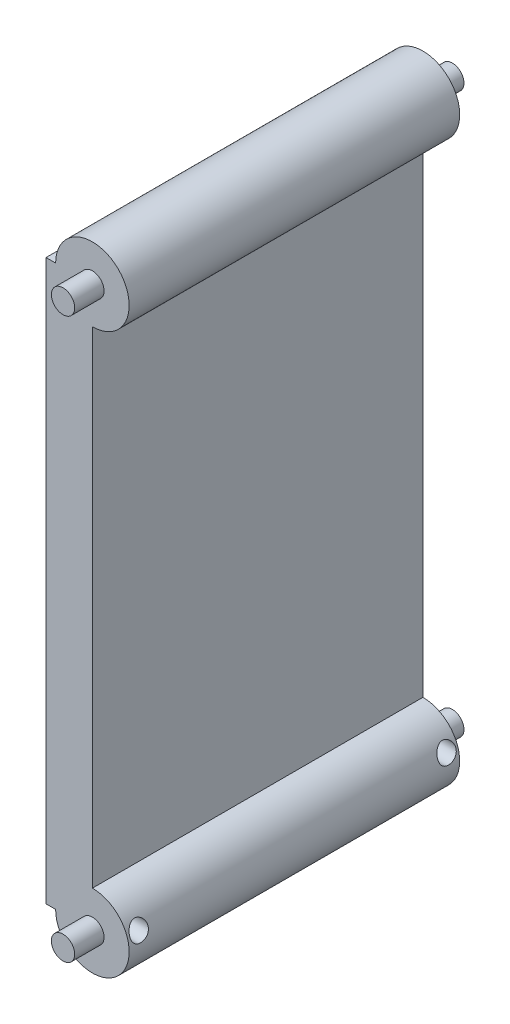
ISO-10303-21;
HEADER;
FILE_DESCRIPTION(('STEP AP214'),'2;1');
FILE_NAME('part.step','',(''),(''),'','','');
FILE_SCHEMA(('AUTOMOTIVE_DESIGN { 1 0 10303 214 1 1 1 1 }'));
ENDSEC;
DATA;
#1=APPLICATION_CONTEXT('core data for automotive mechanical design processes');
#2=APPLICATION_PROTOCOL_DEFINITION('international standard','automotive_design',2000,#1);
#3=PRODUCT_CONTEXT('',#1,'mechanical');
#4=PRODUCT('Part','Part','',(#3));
#5=PRODUCT_RELATED_PRODUCT_CATEGORY('part','',(#4));
#6=PRODUCT_DEFINITION_FORMATION('','',#4);
#7=PRODUCT_DEFINITION_CONTEXT('part definition',#1,'design');
#8=PRODUCT_DEFINITION('design','',#6,#7);
#9=PRODUCT_DEFINITION_SHAPE('','',#8);
#10=(LENGTH_UNIT() NAMED_UNIT(*) SI_UNIT(.MILLI.,.METRE.));
#11=(NAMED_UNIT(*) PLANE_ANGLE_UNIT() SI_UNIT($,.RADIAN.));
#12=(NAMED_UNIT(*) SI_UNIT($,.STERADIAN.) SOLID_ANGLE_UNIT());
#13=UNCERTAINTY_MEASURE_WITH_UNIT(LENGTH_MEASURE(1.E-05),#10,'distance_accuracy_value','');
#14=(GEOMETRIC_REPRESENTATION_CONTEXT(3) GLOBAL_UNCERTAINTY_ASSIGNED_CONTEXT((#13)) GLOBAL_UNIT_ASSIGNED_CONTEXT((#10,
#11,#12)) REPRESENTATION_CONTEXT('',''));
#15=CARTESIAN_POINT('',(0.,0.,0.));
#16=DIRECTION('',(0.,0.,1.));
#17=DIRECTION('',(1.,0.,0.));
#18=AXIS2_PLACEMENT_3D('',#15,#16,#17);
#19=CARTESIAN_POINT('',(-67.6265993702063,0.,89.9922));
#20=DIRECTION('',(0.,1.,0.));
#21=DIRECTION('',(-1.,0.,0.));
#22=AXIS2_PLACEMENT_3D('',#19,#20,#21);
#23=PLANE('',#22);
#24=DIRECTION('',(1.,0.,0.));
#25=VECTOR('',#24,1.);
#26=CARTESIAN_POINT('',(-67.6265993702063,0.,89.9922));
#27=LINE('',#26,#25);
#28=CARTESIAN_POINT('',(-12.6265993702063,0.,89.9922));
#29=VERTEX_POINT('',#28);
#30=CARTESIAN_POINT('',(-10.0076,0.,89.9922));
#31=VERTEX_POINT('',#30);
#32=EDGE_CURVE('E93',#29,#31,#27,.T.);
#33=ORIENTED_EDGE('',*,*,#32,.F.);
#34=DIRECTION('',(0.,0.,1.));
#35=VECTOR('',#34,1.);
#36=CARTESIAN_POINT('',(-12.6265993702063,0.,89.9922));
#37=LINE('',#36,#35);
#38=CARTESIAN_POINT('',(-12.6265993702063,0.,0.));
#39=VERTEX_POINT('',#38);
#40=EDGE_CURVE('E134',#39,#29,#37,.T.);
#41=ORIENTED_EDGE('',*,*,#40,.F.);
#42=DIRECTION('',(1.,0.,0.));
#43=VECTOR('',#42,1.);
#44=CARTESIAN_POINT('',(-67.6265993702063,0.,0.));
#45=LINE('',#44,#43);
#46=CARTESIAN_POINT('',(-10.0076,0.,0.));
#47=VERTEX_POINT('',#46);
#48=EDGE_CURVE('E130',#39,#47,#45,.T.);
#49=ORIENTED_EDGE('',*,*,#48,.T.);
#50=DIRECTION('',(0.,0.,-1.));
#51=VECTOR('',#50,1.);
#52=CARTESIAN_POINT('',(-10.0076,0.,89.9922));
#53=LINE('',#52,#51);
#54=EDGE_CURVE('E153',#31,#47,#53,.T.);
#55=ORIENTED_EDGE('',*,*,#54,.F.);
#56=EDGE_LOOP('',(#33,#41,#49,#55));
#57=FACE_BOUND('',#56,.T.);
#58=ADVANCED_FACE('F40',(#57),#23,.F.);
#59=CARTESIAN_POINT('',(0.,0.,89.9922));
#60=DIRECTION('',(0.,0.,-1.));
#61=DIRECTION('',(-1.,0.,0.));
#62=AXIS2_PLACEMENT_3D('',#59,#60,#61);
#63=CYLINDRICAL_SURFACE('',#62,10.0076);
#64=CARTESIAN_POINT('',(9.9919193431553,0.560004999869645,86.868));
#65=CARTESIAN_POINT('',(9.99191902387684,0.560004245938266,86.7278651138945));
#66=CARTESIAN_POINT('',(9.99127835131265,0.571814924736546,86.5877380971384));
#67=CARTESIAN_POINT('',(9.98848306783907,0.618716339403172,86.3114596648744));
#68=CARTESIAN_POINT('',(9.98632860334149,0.653804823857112,86.1753078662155));
#69=CARTESIAN_POINT('',(9.97984405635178,0.746259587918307,85.9108109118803));
#70=CARTESIAN_POINT('',(9.9755135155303,0.803630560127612,85.7824674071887));
#71=CARTESIAN_POINT('',(9.96368401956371,0.938963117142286,85.5372929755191));
#72=CARTESIAN_POINT('',(9.95618510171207,1.01692445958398,85.4204619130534));
#73=CARTESIAN_POINT('',(9.93689072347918,1.19073619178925,85.2020992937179));
#74=CARTESIAN_POINT('',(9.92511179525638,1.28651706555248,85.1005109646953));
#75=CARTESIAN_POINT('',(9.89613060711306,1.49315570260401,84.9149898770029));
#76=CARTESIAN_POINT('',(9.87892894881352,1.60401179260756,84.8310551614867));
#77=CARTESIAN_POINT('',(9.83838674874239,1.83629255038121,84.683673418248));
#78=CARTESIAN_POINT('',(9.81509683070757,1.95762478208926,84.6200666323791));
#79=CARTESIAN_POINT('',(9.76187381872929,2.20776250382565,84.5138263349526));
#80=CARTESIAN_POINT('',(9.7319407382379,2.33656797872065,84.4711927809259));
#81=CARTESIAN_POINT('',(9.66520619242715,2.59890801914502,84.4071530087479));
#82=CARTESIAN_POINT('',(9.62834528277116,2.73247473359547,84.3859414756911));
#83=CARTESIAN_POINT('',(9.54854713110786,2.99945586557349,84.3651510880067));
#84=CARTESIAN_POINT('',(9.50560857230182,3.13287024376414,84.3655769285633));
#85=CARTESIAN_POINT('',(9.41248269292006,3.40273228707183,84.3877313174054));
#86=CARTESIAN_POINT('',(9.36204245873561,3.5390055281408,84.4105084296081));
#87=CARTESIAN_POINT('',(9.25729535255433,3.80459648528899,84.4775334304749));
#88=CARTESIAN_POINT('',(9.20298717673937,3.93391182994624,84.5217885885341));
#89=CARTESIAN_POINT('',(9.08824302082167,4.19254101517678,84.63445647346));
#90=CARTESIAN_POINT('',(9.02765624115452,4.32109657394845,84.7044594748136));
#91=CARTESIAN_POINT('',(8.90711983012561,4.56439938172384,84.865975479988));
#92=CARTESIAN_POINT('',(8.84717074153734,4.67913561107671,84.9575054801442));
#93=CARTESIAN_POINT('',(8.72905867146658,4.8960621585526,85.1644190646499));
#94=CARTESIAN_POINT('',(8.67105535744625,4.99759257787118,85.280590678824));
#95=CARTESIAN_POINT('',(8.56397175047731,5.17895259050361,85.5323387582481));
#96=CARTESIAN_POINT('',(8.51487811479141,5.25881472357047,85.667885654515));
#97=CARTESIAN_POINT('',(8.44072160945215,5.37679567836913,85.9208888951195));
#98=CARTESIAN_POINT('',(8.4127202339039,5.42032594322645,86.0349698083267));
#99=CARTESIAN_POINT('',(8.36705883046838,5.49055145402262,86.270158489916));
#100=CARTESIAN_POINT('',(8.34938921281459,5.5172623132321,86.3912596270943));
#101=CARTESIAN_POINT('',(8.32600625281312,5.55249004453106,86.6377384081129));
#102=CARTESIAN_POINT('',(8.32033979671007,5.56093557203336,86.7631308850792));
#103=CARTESIAN_POINT('',(8.32170818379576,5.55888772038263,87.0136985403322));
#104=CARTESIAN_POINT('',(8.32874321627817,5.54839405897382,87.1388737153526));
#105=CARTESIAN_POINT('',(8.35394864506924,5.51035943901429,87.3773001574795));
#106=CARTESIAN_POINT('',(8.37139884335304,5.48391997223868,87.4908086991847));
#107=CARTESIAN_POINT('',(8.41534061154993,5.41624560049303,87.7114508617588));
#108=CARTESIAN_POINT('',(8.44183438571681,5.37500708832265,87.8185829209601));
#109=CARTESIAN_POINT('',(8.50419228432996,5.27583445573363,88.0319957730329));
#110=CARTESIAN_POINT('',(8.54059548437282,5.21690863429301,88.1376547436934));
#111=CARTESIAN_POINT('',(8.61933568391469,5.08576059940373,88.3379032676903));
#112=CARTESIAN_POINT('',(8.66167566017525,5.01353170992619,88.4324872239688));
#113=CARTESIAN_POINT('',(8.75692172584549,4.84551885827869,88.6231100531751));
#114=CARTESIAN_POINT('',(8.81045288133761,4.74782152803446,88.7171526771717));
#115=CARTESIAN_POINT('',(8.91968104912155,4.53929760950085,88.8878596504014));
#116=CARTESIAN_POINT('',(8.97537940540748,4.42846278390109,88.9645130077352));
#117=CARTESIAN_POINT('',(9.09273380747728,4.18267639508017,89.1067322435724));
#118=CARTESIAN_POINT('',(9.15435477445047,4.04641450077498,89.1700789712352));
#119=CARTESIAN_POINT('',(9.27427942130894,3.76343010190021,89.2716967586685));
#120=CARTESIAN_POINT('',(9.33258284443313,3.61670678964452,89.3099658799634));
#121=CARTESIAN_POINT('',(9.44330472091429,3.31685487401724,89.3593917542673));
#122=CARTESIAN_POINT('',(9.49573365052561,3.16373836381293,89.370597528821));
#123=CARTESIAN_POINT('',(9.59288210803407,2.85564528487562,89.3643800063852));
#124=CARTESIAN_POINT('',(9.63760590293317,2.70066979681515,89.3469726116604));
#125=CARTESIAN_POINT('',(9.71517150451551,2.4060289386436,89.2852766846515));
#126=CARTESIAN_POINT('',(9.74865361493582,2.26608816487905,89.2431062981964));
#127=CARTESIAN_POINT('',(9.80785148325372,1.99435070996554,89.1342224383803));
#128=CARTESIAN_POINT('',(9.83356996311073,1.86255118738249,89.0675175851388));
#129=CARTESIAN_POINT('',(9.87642751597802,1.61944281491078,88.9159405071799));
#130=CARTESIAN_POINT('',(9.89398740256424,1.50738017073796,88.8323919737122));
#131=CARTESIAN_POINT('',(9.92358104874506,1.29836602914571,88.6473523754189));
#132=CARTESIAN_POINT('',(9.93561539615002,1.20141292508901,88.5458632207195));
#133=CARTESIAN_POINT('',(9.95515964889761,1.02688234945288,88.3293305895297));
#134=CARTESIAN_POINT('',(9.9627286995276,0.949059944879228,88.2144895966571));
#135=CARTESIAN_POINT('',(9.97472272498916,0.813399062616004,87.973394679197));
#136=CARTESIAN_POINT('',(9.97914726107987,0.755563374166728,87.8471391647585));
#137=CARTESIAN_POINT('',(9.98596454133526,0.659550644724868,87.5811912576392));
#138=CARTESIAN_POINT('',(9.98826278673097,0.62231515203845,87.4411556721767));
#139=CARTESIAN_POINT('',(9.99124037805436,0.572542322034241,87.1567440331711));
#140=CARTESIAN_POINT('',(9.99191967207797,0.56000577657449,87.0123678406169));
#141=CARTESIAN_POINT('',(9.9919193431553,0.560004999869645,86.868));
#142=B_SPLINE_CURVE_WITH_KNOTS('',3,(#64,#65,#66,#67,#68,#69,#70,#71,#72,#73,#74,#75,#76,#77,
#78,#79,#80,#81,#82,#83,#84,#85,#86,#87,#88,#89,#90,#91,#92,#93,#94,#95,#96,#97,#98,#99,#100,
#101,#102,#103,#104,#105,#106,#107,#108,#109,#110,#111,#112,#113,#114,#115,#116,#117,#118,#119,
#120,#121,#122,#123,#124,#125,#126,#127,#128,#129,#130,#131,#132,#133,#134,#135,#136,#137,#138,
#139,#140,#141),.UNSPECIFIED.,.T.,.F.,(4,2,2,2,2,2,2,2,2,2,2,2,2,2,2,2,2,2,2,2,2,2,2,2,2,2,2,2,
2,2,2,2,2,2,2,2,2,2,4),(0.,0.419895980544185,0.839751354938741,1.25969519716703,
1.67963409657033,2.09796787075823,2.51625524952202,2.93116948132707,3.34608287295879,
3.76473398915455,4.18347595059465,4.62284958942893,5.06237204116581,5.53554862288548,
6.00910005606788,6.5010338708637,6.99222479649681,7.36647987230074,7.74038701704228,
8.11575202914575,8.49112263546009,8.84313390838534,9.195231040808,9.57279051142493,
9.95053997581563,10.3861501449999,10.8220349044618,11.3069823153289,11.7919672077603,
12.2760729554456,12.7599097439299,13.2073907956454,13.6547147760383,14.075310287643,
14.4958610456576,14.9107084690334,15.3256137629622,15.758179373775,16.190758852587),.UNSPECIFIED.);
#143=CARTESIAN_POINT('',(9.9919193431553,0.560004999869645,86.868));
#144=VERTEX_POINT('',#143);
#145=EDGE_CURVE('E224',#144,#144,#142,.T.);
#146=ORIENTED_EDGE('',*,*,#145,.F.);
#147=EDGE_LOOP('',(#146));
#148=FACE_BOUND('',#147,.T.);
#149=CARTESIAN_POINT('',(9.9919193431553,0.560004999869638,3.04799999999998));
#150=CARTESIAN_POINT('',(9.99191902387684,0.56000424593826,2.90786511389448));
#151=CARTESIAN_POINT('',(9.99127835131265,0.571814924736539,2.76773809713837));
#152=CARTESIAN_POINT('',(9.98848306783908,0.618716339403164,2.49145966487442));
#153=CARTESIAN_POINT('',(9.98632860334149,0.653804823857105,2.35530786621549));
#154=CARTESIAN_POINT('',(9.97984405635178,0.746259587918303,2.09081091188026));
#155=CARTESIAN_POINT('',(9.9755135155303,0.803630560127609,1.96246740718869));
#156=CARTESIAN_POINT('',(9.96368401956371,0.938963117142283,1.7172929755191));
#157=CARTESIAN_POINT('',(9.95618510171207,1.01692445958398,1.60046191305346));
#158=CARTESIAN_POINT('',(9.93689072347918,1.19073619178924,1.38209929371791));
#159=CARTESIAN_POINT('',(9.92511179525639,1.28651706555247,1.28051096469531));
#160=CARTESIAN_POINT('',(9.89613060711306,1.493155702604,1.09498987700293));
#161=CARTESIAN_POINT('',(9.87892894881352,1.60401179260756,1.01105516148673));
#162=CARTESIAN_POINT('',(9.83838674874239,1.83629255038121,0.863673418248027));
#163=CARTESIAN_POINT('',(9.81509683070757,1.95762478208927,0.800066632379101));
#164=CARTESIAN_POINT('',(9.76187381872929,2.20776250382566,0.693826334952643));
#165=CARTESIAN_POINT('',(9.7319407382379,2.33656797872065,0.651192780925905));
#166=CARTESIAN_POINT('',(9.66520619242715,2.59890801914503,0.587153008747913));
#167=CARTESIAN_POINT('',(9.62834528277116,2.73247473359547,0.565941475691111));
#168=CARTESIAN_POINT('',(9.54854713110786,2.99945586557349,0.545151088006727));
#169=CARTESIAN_POINT('',(9.50560857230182,3.13287024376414,0.545576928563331));
#170=CARTESIAN_POINT('',(9.41248269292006,3.40273228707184,0.567731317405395));
#171=CARTESIAN_POINT('',(9.36204245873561,3.53900552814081,0.590508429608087));
#172=CARTESIAN_POINT('',(9.25729535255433,3.80459648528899,0.657533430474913));
#173=CARTESIAN_POINT('',(9.20298717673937,3.93391182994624,0.701788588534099));
#174=CARTESIAN_POINT('',(9.08824302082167,4.19254101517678,0.814456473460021));
#175=CARTESIAN_POINT('',(9.02765624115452,4.32109657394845,0.88445947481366));
#176=CARTESIAN_POINT('',(8.90711983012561,4.56439938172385,1.045975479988));
#177=CARTESIAN_POINT('',(8.84717074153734,4.67913561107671,1.13750548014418));
#178=CARTESIAN_POINT('',(8.72905867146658,4.89606215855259,1.34441906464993));
#179=CARTESIAN_POINT('',(8.67105535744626,4.99759257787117,1.46059067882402));
#180=CARTESIAN_POINT('',(8.56397175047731,5.1789525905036,1.7123387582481));
#181=CARTESIAN_POINT('',(8.51487811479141,5.25881472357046,1.84788565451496));
#182=CARTESIAN_POINT('',(8.44072160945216,5.37679567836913,2.10088889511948));
#183=CARTESIAN_POINT('',(8.41272023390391,5.42032594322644,2.21496980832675));
#184=CARTESIAN_POINT('',(8.36705883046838,5.49055145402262,2.450158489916));
#185=CARTESIAN_POINT('',(8.3493892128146,5.51726231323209,2.57125962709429));
#186=CARTESIAN_POINT('',(8.32600625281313,5.55249004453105,2.81773840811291));
#187=CARTESIAN_POINT('',(8.32033979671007,5.56093557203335,2.94313088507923));
#188=CARTESIAN_POINT('',(8.32170818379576,5.55888772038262,3.19369854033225));
#189=CARTESIAN_POINT('',(8.32874321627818,5.54839405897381,3.3188737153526));
#190=CARTESIAN_POINT('',(8.35394864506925,5.51035943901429,3.55730015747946));
#191=CARTESIAN_POINT('',(8.37139884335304,5.48391997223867,3.6708086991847));
#192=CARTESIAN_POINT('',(8.41534061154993,5.41624560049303,3.89145086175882));
#193=CARTESIAN_POINT('',(8.44183438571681,5.37500708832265,3.99858292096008));
#194=CARTESIAN_POINT('',(8.50419228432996,5.27583445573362,4.2119957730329));
#195=CARTESIAN_POINT('',(8.54059548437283,5.21690863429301,4.31765474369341));
#196=CARTESIAN_POINT('',(8.61933568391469,5.08576059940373,4.51790326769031));
#197=CARTESIAN_POINT('',(8.66167566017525,5.01353170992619,4.61248722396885));
#198=CARTESIAN_POINT('',(8.75692172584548,4.84551885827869,4.80311005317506));
#199=CARTESIAN_POINT('',(8.8104528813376,4.74782152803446,4.89715267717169));
#200=CARTESIAN_POINT('',(8.91968104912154,4.53929760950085,5.06785965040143));
#201=CARTESIAN_POINT('',(8.97537940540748,4.42846278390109,5.14451300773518));
#202=CARTESIAN_POINT('',(9.09273380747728,4.18267639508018,5.28673224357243));
#203=CARTESIAN_POINT('',(9.15435477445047,4.04641450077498,5.3500789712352));
#204=CARTESIAN_POINT('',(9.27427942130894,3.76343010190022,5.45169675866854));
#205=CARTESIAN_POINT('',(9.33258284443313,3.61670678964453,5.48996587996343));
#206=CARTESIAN_POINT('',(9.44330472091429,3.31685487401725,5.53939175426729));
#207=CARTESIAN_POINT('',(9.4957336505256,3.16373836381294,5.55059752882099));
#208=CARTESIAN_POINT('',(9.59288210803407,2.85564528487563,5.54438000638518));
#209=CARTESIAN_POINT('',(9.63760590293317,2.70066979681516,5.52697261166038));
#210=CARTESIAN_POINT('',(9.71517150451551,2.4060289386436,5.46527668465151));
#211=CARTESIAN_POINT('',(9.74865361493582,2.26608816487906,5.42310629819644));
#212=CARTESIAN_POINT('',(9.80785148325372,1.99435070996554,5.31422243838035));
#213=CARTESIAN_POINT('',(9.83356996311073,1.86255118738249,5.24751758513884));
#214=CARTESIAN_POINT('',(9.87642751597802,1.61944281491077,5.0959405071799));
#215=CARTESIAN_POINT('',(9.89398740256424,1.50738017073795,5.01239197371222));
#216=CARTESIAN_POINT('',(9.92358104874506,1.2983660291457,4.82735237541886));
#217=CARTESIAN_POINT('',(9.93561539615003,1.201412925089,4.72586322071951));
#218=CARTESIAN_POINT('',(9.95515964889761,1.02688234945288,4.50933058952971));
#219=CARTESIAN_POINT('',(9.9627286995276,0.949059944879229,4.39448959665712));
#220=CARTESIAN_POINT('',(9.97472272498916,0.813399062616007,4.15339467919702));
#221=CARTESIAN_POINT('',(9.97914726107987,0.755563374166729,4.02713916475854));
#222=CARTESIAN_POINT('',(9.98596454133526,0.659550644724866,3.7611912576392));
#223=CARTESIAN_POINT('',(9.98826278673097,0.622315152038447,3.62115567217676));
#224=CARTESIAN_POINT('',(9.99124037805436,0.572542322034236,3.3367440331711));
#225=CARTESIAN_POINT('',(9.99191967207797,0.560005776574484,3.19236784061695));
#226=CARTESIAN_POINT('',(9.9919193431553,0.560004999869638,3.04799999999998));
#227=B_SPLINE_CURVE_WITH_KNOTS('',3,(#149,#150,#151,#152,#153,#154,#155,#156,#157,#158,#159,
#160,#161,#162,#163,#164,#165,#166,#167,#168,#169,#170,#171,#172,#173,#174,#175,#176,#177,#178,
#179,#180,#181,#182,#183,#184,#185,#186,#187,#188,#189,#190,#191,#192,#193,#194,#195,#196,#197,
#198,#199,#200,#201,#202,#203,#204,#205,#206,#207,#208,#209,#210,#211,#212,#213,#214,#215,#216,
#217,#218,#219,#220,#221,#222,#223,#224,#225,#226),.UNSPECIFIED.,.T.,.F.,(4,2,2,2,2,2,2,2,2,2,2,
2,2,2,2,2,2,2,2,2,2,2,2,2,2,2,2,2,2,2,2,2,2,2,2,2,2,2,4),(0.,0.41989598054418,0.839751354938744,
1.25969519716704,1.67963409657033,2.09796787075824,2.51625524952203,2.93116948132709,
3.3460828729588,3.76473398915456,4.18347595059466,4.62284958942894,5.06237204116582,
5.5355486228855,6.00910005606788,6.50103387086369,6.9922247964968,7.36647987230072,
7.74038701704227,8.11575202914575,8.49112263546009,8.84313390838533,9.19523104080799,
9.57279051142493,9.95053997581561,10.3861501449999,10.8220349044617,11.3069823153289,
11.7919672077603,12.2760729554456,12.7599097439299,13.2073907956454,13.6547147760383,
14.0753102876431,14.4958610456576,14.9107084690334,15.3256137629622,15.758179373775,
16.190758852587),.UNSPECIFIED.);
#228=CARTESIAN_POINT('',(9.9919193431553,0.560004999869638,3.04799999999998));
#229=VERTEX_POINT('',#228);
#230=EDGE_CURVE('E225',#229,#229,#227,.T.);
#231=ORIENTED_EDGE('',*,*,#230,.F.);
#232=EDGE_LOOP('',(#231));
#233=FACE_BOUND('',#232,.T.);
#234=CARTESIAN_POINT('',(0.,0.,0.));
#235=DIRECTION('',(0.,0.,1.));
#236=DIRECTION('',(1.,0.,0.));
#237=AXIS2_PLACEMENT_3D('',#234,#235,#236);
#238=CIRCLE('',#237,10.0076);
#239=CARTESIAN_POINT('',(0.,10.0076,0.));
#240=VERTEX_POINT('',#239);
#241=EDGE_CURVE('E133',#47,#240,#238,.T.);
#242=ORIENTED_EDGE('',*,*,#241,.T.);
#243=DIRECTION('',(0.,0.,-1.));
#244=VECTOR('',#243,1.);
#245=CARTESIAN_POINT('',(0.,10.0076,89.9922));
#246=LINE('',#245,#244);
#247=CARTESIAN_POINT('',(0.,10.0076,89.9922));
#248=VERTEX_POINT('',#247);
#249=EDGE_CURVE('E117',#248,#240,#246,.T.);
#250=ORIENTED_EDGE('',*,*,#249,.F.);
#251=CARTESIAN_POINT('',(0.,0.,89.9922));
#252=DIRECTION('',(0.,0.,1.));
#253=DIRECTION('',(1.,0.,0.));
#254=AXIS2_PLACEMENT_3D('',#251,#252,#253);
#255=CIRCLE('',#254,10.0076);
#256=EDGE_CURVE('E106',#31,#248,#255,.T.);
#257=ORIENTED_EDGE('',*,*,#256,.F.);
#258=ORIENTED_EDGE('',*,*,#54,.T.);
#259=EDGE_LOOP('',(#242,#250,#257,#258));
#260=FACE_BOUND('',#259,.T.);
#261=ADVANCED_FACE('F190',(#148,#233,#260),#63,.T.);
#262=CARTESIAN_POINT('',(0.,10.0076,89.9922));
#263=DIRECTION('',(-1.,0.,0.));
#264=DIRECTION('',(0.,0.,1.));
#265=AXIS2_PLACEMENT_3D('',#262,#263,#264);
#266=PLANE('',#265);
#267=DIRECTION('',(0.,1.,0.));
#268=VECTOR('',#267,1.);
#269=CARTESIAN_POINT('',(0.,10.0076,0.));
#270=LINE('',#269,#268);
#271=CARTESIAN_POINT('',(0.,142.3924,0.));
#272=VERTEX_POINT('',#271);
#273=EDGE_CURVE('E115',#240,#272,#270,.T.);
#274=ORIENTED_EDGE('',*,*,#273,.T.);
#275=DIRECTION('',(0.,0.,-1.));
#276=VECTOR('',#275,1.);
#277=CARTESIAN_POINT('',(0.,142.3924,89.9922));
#278=LINE('',#277,#276);
#279=CARTESIAN_POINT('',(0.,142.3924,89.9922));
#280=VERTEX_POINT('',#279);
#281=EDGE_CURVE('E112',#280,#272,#278,.T.);
#282=ORIENTED_EDGE('',*,*,#281,.F.);
#283=DIRECTION('',(0.,1.,0.));
#284=VECTOR('',#283,1.);
#285=CARTESIAN_POINT('',(0.,10.0076,89.9922));
#286=LINE('',#285,#284);
#287=EDGE_CURVE('E100',#248,#280,#286,.T.);
#288=ORIENTED_EDGE('',*,*,#287,.F.);
#289=ORIENTED_EDGE('',*,*,#249,.T.);
#290=EDGE_LOOP('',(#274,#282,#288,#289));
#291=FACE_BOUND('',#290,.T.);
#292=ADVANCED_FACE('F113',(#291),#266,.F.);
#293=CARTESIAN_POINT('',(0.,152.4,89.9922));
#294=DIRECTION('',(0.,0.,-1.));
#295=DIRECTION('',(-1.,0.,0.));
#296=AXIS2_PLACEMENT_3D('',#293,#294,#295);
#297=CYLINDRICAL_SURFACE('',#296,10.0076);
#298=CARTESIAN_POINT('',(0.,152.4,0.));
#299=DIRECTION('',(0.,0.,1.));
#300=DIRECTION('',(1.,0.,0.));
#301=AXIS2_PLACEMENT_3D('',#298,#299,#300);
#302=CIRCLE('',#301,10.0076);
#303=CARTESIAN_POINT('',(-10.0076,152.4,0.));
#304=VERTEX_POINT('',#303);
#305=EDGE_CURVE('E79',#272,#304,#302,.T.);
#306=ORIENTED_EDGE('',*,*,#305,.T.);
#307=DIRECTION('',(0.,0.,-1.));
#308=VECTOR('',#307,1.);
#309=CARTESIAN_POINT('',(-10.0076,152.4,89.9922));
#310=LINE('',#309,#308);
#311=CARTESIAN_POINT('',(-10.0076,152.4,89.9922));
#312=VERTEX_POINT('',#311);
#313=EDGE_CURVE('E118',#312,#304,#310,.T.);
#314=ORIENTED_EDGE('',*,*,#313,.F.);
#315=CARTESIAN_POINT('',(0.,152.4,89.9922));
#316=DIRECTION('',(0.,0.,1.));
#317=DIRECTION('',(1.,0.,0.));
#318=AXIS2_PLACEMENT_3D('',#315,#316,#317);
#319=CIRCLE('',#318,10.0076);
#320=EDGE_CURVE('E104',#280,#312,#319,.T.);
#321=ORIENTED_EDGE('',*,*,#320,.F.);
#322=ORIENTED_EDGE('',*,*,#281,.T.);
#323=EDGE_LOOP('',(#306,#314,#321,#322));
#324=FACE_BOUND('',#323,.T.);
#325=ADVANCED_FACE('F120',(#324),#297,.T.);
#326=CARTESIAN_POINT('',(-10.0076,152.4,89.9922));
#327=DIRECTION('',(0.,-1.,0.));
#328=DIRECTION('',(0.,0.,-1.));
#329=AXIS2_PLACEMENT_3D('',#326,#327,#328);
#330=PLANE('',#329);
#331=DIRECTION('',(-1.,0.,0.));
#332=VECTOR('',#331,1.);
#333=CARTESIAN_POINT('',(-10.0076,152.4,0.));
#334=LINE('',#333,#332);
#335=CARTESIAN_POINT('',(-12.6265993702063,152.4,0.));
#336=VERTEX_POINT('',#335);
#337=EDGE_CURVE('E86',#304,#336,#334,.T.);
#338=ORIENTED_EDGE('',*,*,#337,.T.);
#339=DIRECTION('',(0.,0.,-1.));
#340=VECTOR('',#339,1.);
#341=CARTESIAN_POINT('',(-12.6265993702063,152.4,89.9922));
#342=LINE('',#341,#340);
#343=CARTESIAN_POINT('',(-12.6265993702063,152.4,89.9922));
#344=VERTEX_POINT('',#343);
#345=EDGE_CURVE('E126',#344,#336,#342,.T.);
#346=ORIENTED_EDGE('',*,*,#345,.F.);
#347=DIRECTION('',(-1.,0.,0.));
#348=VECTOR('',#347,1.);
#349=CARTESIAN_POINT('',(-10.0076,152.4,89.9922));
#350=LINE('',#349,#348);
#351=EDGE_CURVE('E123',#312,#344,#350,.T.);
#352=ORIENTED_EDGE('',*,*,#351,.F.);
#353=ORIENTED_EDGE('',*,*,#313,.T.);
#354=EDGE_LOOP('',(#338,#346,#352,#353));
#355=FACE_BOUND('',#354,.T.);
#356=ADVANCED_FACE('F184',(#355),#330,.F.);
#357=CARTESIAN_POINT('',(-12.6265993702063,152.4,89.9922));
#358=DIRECTION('',(1.,0.,0.));
#359=DIRECTION('',(0.,1.,0.));
#360=AXIS2_PLACEMENT_3D('',#357,#358,#359);
#361=PLANE('',#360);
#362=CARTESIAN_POINT('',(-12.6265993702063,3.05999999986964,86.868));
#363=DIRECTION('',(-1.,0.,0.));
#364=DIRECTION('',(0.,-1.,0.));
#365=AXIS2_PLACEMENT_3D('',#362,#363,#364);
#366=CIRCLE('',#365,2.499995);
#367=CARTESIAN_POINT('',(-12.6265993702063,0.560004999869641,86.868));
#368=VERTEX_POINT('',#367);
#369=EDGE_CURVE('E234',#368,#368,#366,.T.);
#370=ORIENTED_EDGE('',*,*,#369,.F.);
#371=EDGE_LOOP('',(#370));
#372=FACE_BOUND('',#371,.T.);
#373=CARTESIAN_POINT('',(-12.6265993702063,3.05999999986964,3.04799999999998));
#374=DIRECTION('',(-1.,0.,0.));
#375=DIRECTION('',(0.,-1.,0.));
#376=AXIS2_PLACEMENT_3D('',#373,#374,#375);
#377=CIRCLE('',#376,2.499995);
#378=CARTESIAN_POINT('',(-12.6265993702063,0.560004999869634,3.04799999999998));
#379=VERTEX_POINT('',#378);
#380=EDGE_CURVE('E235',#379,#379,#377,.T.);
#381=ORIENTED_EDGE('',*,*,#380,.F.);
#382=EDGE_LOOP('',(#381));
#383=FACE_BOUND('',#382,.T.);
#384=DIRECTION('',(0.,-1.,0.));
#385=VECTOR('',#384,1.);
#386=CARTESIAN_POINT('',(-12.6265993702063,152.4,0.));
#387=LINE('',#386,#385);
#388=EDGE_CURVE('E143',#336,#39,#387,.T.);
#389=ORIENTED_EDGE('',*,*,#388,.T.);
#390=ORIENTED_EDGE('',*,*,#40,.T.);
#391=DIRECTION('',(0.,-1.,0.));
#392=VECTOR('',#391,1.);
#393=CARTESIAN_POINT('',(-12.6265993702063,19.6849999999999,89.9922));
#394=LINE('',#393,#392);
#395=EDGE_CURVE('E57',#344,#29,#394,.T.);
#396=ORIENTED_EDGE('',*,*,#395,.F.);
#397=ORIENTED_EDGE('',*,*,#345,.T.);
#398=EDGE_LOOP('',(#389,#390,#396,#397));
#399=FACE_BOUND('',#398,.T.);
#400=ADVANCED_FACE('F173',(#372,#383,#399),#361,.F.);
#401=CARTESIAN_POINT('',(0.,0.,89.9922));
#402=DIRECTION('',(0.,0.,1.));
#403=DIRECTION('',(1.,0.,0.));
#404=AXIS2_PLACEMENT_3D('',#401,#402,#403);
#405=PLANE('',#404);
#406=CARTESIAN_POINT('',(0.,152.4,89.9922));
#407=DIRECTION('',(0.,0.,1.));
#408=DIRECTION('',(1.,0.,0.));
#409=AXIS2_PLACEMENT_3D('',#406,#407,#408);
#410=CIRCLE('',#409,3.175);
#411=CARTESIAN_POINT('',(3.175,152.4,89.9922));
#412=VERTEX_POINT('',#411);
#413=EDGE_CURVE('E12',#412,#412,#410,.T.);
#414=ORIENTED_EDGE('',*,*,#413,.F.);
#415=EDGE_LOOP('',(#414));
#416=FACE_BOUND('',#415,.T.);
#417=CARTESIAN_POINT('',(0.,0.,89.9922));
#418=DIRECTION('',(0.,0.,1.));
#419=DIRECTION('',(1.,0.,0.));
#420=AXIS2_PLACEMENT_3D('',#417,#418,#419);
#421=CIRCLE('',#420,3.175);
#422=CARTESIAN_POINT('',(3.175,0.,89.9922));
#423=VERTEX_POINT('',#422);
#424=EDGE_CURVE('E49',#423,#423,#421,.T.);
#425=ORIENTED_EDGE('',*,*,#424,.F.);
#426=EDGE_LOOP('',(#425));
#427=FACE_BOUND('',#426,.T.);
#428=ORIENTED_EDGE('',*,*,#395,.T.);
#429=ORIENTED_EDGE('',*,*,#32,.T.);
#430=ORIENTED_EDGE('',*,*,#256,.T.);
#431=ORIENTED_EDGE('',*,*,#287,.T.);
#432=ORIENTED_EDGE('',*,*,#320,.T.);
#433=ORIENTED_EDGE('',*,*,#351,.T.);
#434=EDGE_LOOP('',(#428,#429,#430,#431,#432,#433));
#435=FACE_BOUND('',#434,.T.);
#436=ADVANCED_FACE('F102',(#416,#427,#435),#405,.T.);
#437=CARTESIAN_POINT('',(0.,0.,0.));
#438=DIRECTION('',(0.,0.,1.));
#439=DIRECTION('',(1.,0.,0.));
#440=AXIS2_PLACEMENT_3D('',#437,#438,#439);
#441=PLANE('',#440);
#442=CARTESIAN_POINT('',(0.,152.4,0.));
#443=DIRECTION('',(0.,0.,1.));
#444=DIRECTION('',(1.,0.,0.));
#445=AXIS2_PLACEMENT_3D('',#442,#443,#444);
#446=CIRCLE('',#445,3.175);
#447=CARTESIAN_POINT('',(3.175,152.4,0.));
#448=VERTEX_POINT('',#447);
#449=EDGE_CURVE('E161',#448,#448,#446,.F.);
#450=ORIENTED_EDGE('',*,*,#449,.F.);
#451=EDGE_LOOP('',(#450));
#452=FACE_BOUND('',#451,.T.);
#453=CARTESIAN_POINT('',(0.,0.,0.));
#454=DIRECTION('',(0.,0.,1.));
#455=DIRECTION('',(1.,0.,0.));
#456=AXIS2_PLACEMENT_3D('',#453,#454,#455);
#457=CIRCLE('',#456,3.175);
#458=CARTESIAN_POINT('',(3.175,0.,0.));
#459=VERTEX_POINT('',#458);
#460=EDGE_CURVE('E157',#459,#459,#457,.F.);
#461=ORIENTED_EDGE('',*,*,#460,.F.);
#462=EDGE_LOOP('',(#461));
#463=FACE_BOUND('',#462,.T.);
#464=ORIENTED_EDGE('',*,*,#48,.F.);
#465=ORIENTED_EDGE('',*,*,#388,.F.);
#466=ORIENTED_EDGE('',*,*,#337,.F.);
#467=ORIENTED_EDGE('',*,*,#305,.F.);
#468=ORIENTED_EDGE('',*,*,#273,.F.);
#469=ORIENTED_EDGE('',*,*,#241,.F.);
#470=EDGE_LOOP('',(#464,#465,#466,#467,#468,#469));
#471=FACE_BOUND('',#470,.T.);
#472=ADVANCED_FACE('F172',(#452,#463,#471),#441,.F.);
#473=CARTESIAN_POINT('',(0.,0.,-24.9822561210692));
#474=DIRECTION('',(0.,0.,1.));
#475=DIRECTION('',(1.,0.,0.));
#476=AXIS2_PLACEMENT_3D('',#473,#474,#475);
#477=CYLINDRICAL_SURFACE('',#476,3.175);
#478=CARTESIAN_POINT('',(0.,0.,-8.001));
#479=DIRECTION('',(0.,0.,1.));
#480=DIRECTION('',(1.,0.,0.));
#481=AXIS2_PLACEMENT_3D('',#478,#479,#480);
#482=CIRCLE('',#481,3.175);
#483=CARTESIAN_POINT('',(3.175,0.,-8.001));
#484=VERTEX_POINT('',#483);
#485=EDGE_CURVE('E208',#484,#484,#482,.T.);
#486=ORIENTED_EDGE('',*,*,#485,.T.);
#487=EDGE_LOOP('',(#486));
#488=FACE_BOUND('',#487,.T.);
#489=ORIENTED_EDGE('',*,*,#460,.T.);
#490=EDGE_LOOP('',(#489));
#491=FACE_BOUND('',#490,.T.);
#492=ADVANCED_FACE('F180',(#488,#491),#477,.T.);
#493=CARTESIAN_POINT('',(0.,0.,-8.001));
#494=DIRECTION('',(0.,0.,1.));
#495=DIRECTION('',(1.,0.,0.));
#496=AXIS2_PLACEMENT_3D('',#493,#494,#495);
#497=PLANE('',#496);
#498=ORIENTED_EDGE('',*,*,#485,.F.);
#499=EDGE_LOOP('',(#498));
#500=FACE_BOUND('',#499,.T.);
#501=ADVANCED_FACE('F263',(#500),#497,.F.);
#502=CARTESIAN_POINT('',(0.,152.4,-24.9822561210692));
#503=DIRECTION('',(0.,0.,1.));
#504=DIRECTION('',(1.,0.,0.));
#505=AXIS2_PLACEMENT_3D('',#502,#503,#504);
#506=CYLINDRICAL_SURFACE('',#505,3.175);
#507=CARTESIAN_POINT('',(0.,152.4,-8.001));
#508=DIRECTION('',(0.,0.,1.));
#509=DIRECTION('',(1.,0.,0.));
#510=AXIS2_PLACEMENT_3D('',#507,#508,#509);
#511=CIRCLE('',#510,3.175);
#512=CARTESIAN_POINT('',(3.175,152.4,-8.001));
#513=VERTEX_POINT('',#512);
#514=EDGE_CURVE('E212',#513,#513,#511,.T.);
#515=ORIENTED_EDGE('',*,*,#514,.T.);
#516=EDGE_LOOP('',(#515));
#517=FACE_BOUND('',#516,.T.);
#518=ORIENTED_EDGE('',*,*,#449,.T.);
#519=EDGE_LOOP('',(#518));
#520=FACE_BOUND('',#519,.T.);
#521=ADVANCED_FACE('F259',(#517,#520),#506,.T.);
#522=CARTESIAN_POINT('',(0.,0.,-8.001));
#523=DIRECTION('',(0.,0.,1.));
#524=DIRECTION('',(1.,0.,0.));
#525=AXIS2_PLACEMENT_3D('',#522,#523,#524);
#526=PLANE('',#525);
#527=ORIENTED_EDGE('',*,*,#514,.F.);
#528=EDGE_LOOP('',(#527));
#529=FACE_BOUND('',#528,.T.);
#530=ADVANCED_FACE('F255',(#529),#526,.F.);
#531=CARTESIAN_POINT('',(0.,0.,97.9932));
#532=DIRECTION('',(0.,0.,1.));
#533=DIRECTION('',(1.,0.,0.));
#534=AXIS2_PLACEMENT_3D('',#531,#532,#533);
#535=PLANE('',#534);
#536=CARTESIAN_POINT('',(0.,0.,97.9932));
#537=DIRECTION('',(0.,0.,1.));
#538=DIRECTION('',(1.,0.,0.));
#539=AXIS2_PLACEMENT_3D('',#536,#537,#538);
#540=CIRCLE('',#539,3.175);
#541=CARTESIAN_POINT('',(3.175,0.,97.9932));
#542=VERTEX_POINT('',#541);
#543=EDGE_CURVE('E216',#542,#542,#540,.F.);
#544=ORIENTED_EDGE('',*,*,#543,.F.);
#545=EDGE_LOOP('',(#544));
#546=FACE_BOUND('',#545,.T.);
#547=ADVANCED_FACE('F252',(#546),#535,.T.);
#548=CARTESIAN_POINT('',(0.,0.,114.974456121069));
#549=DIRECTION('',(0.,0.,-1.));
#550=DIRECTION('',(-1.,0.,0.));
#551=AXIS2_PLACEMENT_3D('',#548,#549,#550);
#552=CYLINDRICAL_SURFACE('',#551,3.175);
#553=ORIENTED_EDGE('',*,*,#424,.T.);
#554=EDGE_LOOP('',(#553));
#555=FACE_BOUND('',#554,.T.);
#556=ORIENTED_EDGE('',*,*,#543,.T.);
#557=EDGE_LOOP('',(#556));
#558=FACE_BOUND('',#557,.T.);
#559=ADVANCED_FACE('F168',(#555,#558),#552,.T.);
#560=CARTESIAN_POINT('',(0.,0.,97.9932));
#561=DIRECTION('',(0.,0.,1.));
#562=DIRECTION('',(1.,0.,0.));
#563=AXIS2_PLACEMENT_3D('',#560,#561,#562);
#564=PLANE('',#563);
#565=CARTESIAN_POINT('',(0.,152.4,97.9932));
#566=DIRECTION('',(0.,0.,1.));
#567=DIRECTION('',(1.,0.,0.));
#568=AXIS2_PLACEMENT_3D('',#565,#566,#567);
#569=CIRCLE('',#568,3.175);
#570=CARTESIAN_POINT('',(3.175,152.4,97.9932));
#571=VERTEX_POINT('',#570);
#572=EDGE_CURVE('E220',#571,#571,#569,.F.);
#573=ORIENTED_EDGE('',*,*,#572,.F.);
#574=EDGE_LOOP('',(#573));
#575=FACE_BOUND('',#574,.T.);
#576=ADVANCED_FACE('F245',(#575),#564,.T.);
#577=CARTESIAN_POINT('',(0.,152.4,114.974456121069));
#578=DIRECTION('',(0.,0.,-1.));
#579=DIRECTION('',(-1.,0.,0.));
#580=AXIS2_PLACEMENT_3D('',#577,#578,#579);
#581=CYLINDRICAL_SURFACE('',#580,3.175);
#582=ORIENTED_EDGE('',*,*,#413,.T.);
#583=EDGE_LOOP('',(#582));
#584=FACE_BOUND('',#583,.T.);
#585=ORIENTED_EDGE('',*,*,#572,.T.);
#586=EDGE_LOOP('',(#585));
#587=FACE_BOUND('',#586,.T.);
#588=ADVANCED_FACE('F242',(#584,#587),#581,.T.);
#589=CARTESIAN_POINT('',(10.0086,3.05999999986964,3.04799999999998));
#590=DIRECTION('',(-1.,0.,0.));
#591=DIRECTION('',(0.,-1.,0.));
#592=AXIS2_PLACEMENT_3D('',#589,#590,#591);
#593=CYLINDRICAL_SURFACE('',#592,2.499995);
#594=ORIENTED_EDGE('',*,*,#230,.T.);
#595=EDGE_LOOP('',(#594));
#596=FACE_BOUND('',#595,.T.);
#597=ORIENTED_EDGE('',*,*,#380,.T.);
#598=EDGE_LOOP('',(#597));
#599=FACE_BOUND('',#598,.T.);
#600=ADVANCED_FACE('F237',(#596,#599),#593,.F.);
#601=CARTESIAN_POINT('',(10.0086,3.05999999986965,86.868));
#602=DIRECTION('',(-1.,0.,0.));
#603=DIRECTION('',(0.,-1.,0.));
#604=AXIS2_PLACEMENT_3D('',#601,#602,#603);
#605=CYLINDRICAL_SURFACE('',#604,2.499995);
#606=ORIENTED_EDGE('',*,*,#145,.T.);
#607=EDGE_LOOP('',(#606));
#608=FACE_BOUND('',#607,.T.);
#609=ORIENTED_EDGE('',*,*,#369,.T.);
#610=EDGE_LOOP('',(#609));
#611=FACE_BOUND('',#610,.T.);
#612=ADVANCED_FACE('F374',(#608,#611),#605,.F.);
#613=CLOSED_SHELL('',(#58,#261,#292,#325,#356,#400,#436,#472,#492,#501,#521,#530,#547,#559,#576,
#588,#600,#612));
#614=MANIFOLD_SOLID_BREP('B2',#613);
#615=ADVANCED_BREP_SHAPE_REPRESENTATION('',(#18,#614),#14);
#616=SHAPE_DEFINITION_REPRESENTATION(#9,#615);
ENDSEC;
END-ISO-10303-21;
